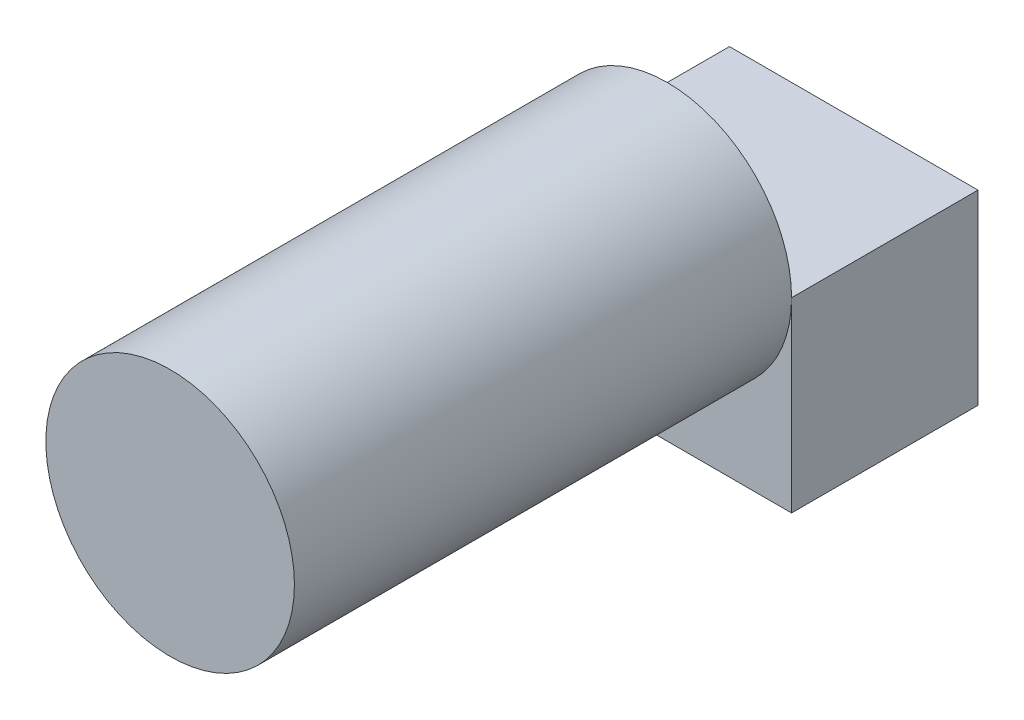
from build123d import *

# Parameters (mm, degrees)
SKIZZE1_W               = 20
SKIZZE1_H               = 15
LINEAR_AUSTRAGEN1_DEPTH = 15
SKIZZE2_R               = 10
LINEAR_AUSTRAGEN2_DEPTH = 40


with BuildPart() as part:
    # Skizze1 → Linear austragen1 (new body)
    with BuildSketch(Plane.XY):
        with Locations((-2.023360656, 0.51557377)):
            Rectangle(SKIZZE1_W, SKIZZE1_H)
    extrude(amount=LINEAR_AUSTRAGEN1_DEPTH)

    # Skizze2 → Linear austragen2 (add)
    with BuildSketch(Plane.XY.offset(15)):
        with Locations((-2.023360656, 8.01557377)):
            Circle(SKIZZE2_R)
    extrude(amount=LINEAR_AUSTRAGEN2_DEPTH)


solid = part.part
